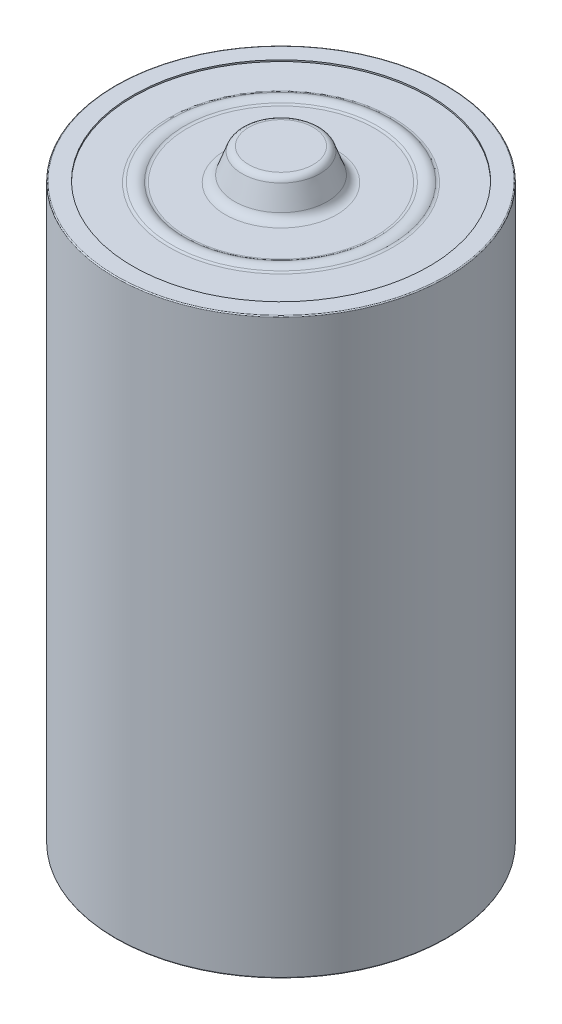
from build123d import *


with BuildPart() as part:
    # Sketch1 → Revolve1 (revolve)
    with BuildSketch(Plane(origin=(0, 0, 0), x_dir=(0, 0, -1), z_dir=(1, 0, 0)), mode=Mode.PRIVATE) as revolve1_sk:
        with BuildLine():
            Line((-16.5, 57.2), (-16.5, 0.3))
            ThreePointArc((-16.5, 0.3), (-16.470710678, 0.229289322), (-16.4, 0.2))
            Line((-16.4, 0.2), (-13.5, 0.2))
            Line((-13.5, 0.2), (-13.5, 0.25))
            Line((-13.5, 0.25), (-12.5, 0.25))
            Line((-12.5, 0.25), (-12.5, 0.35))
            Line((-12.5, 0.35), (-9.694776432, 0.35))
            ThreePointArc((-9.694776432, 0.35), (-9.527885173, 0.321325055), (-9.380136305, 0.238589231))
            ThreePointArc((-9.380136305, 0.238589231), (-8.625, -0.028796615), (-7.869863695, 0.238589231))
            ThreePointArc((-7.869863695, 0.238589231), (-7.722114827, 0.321325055), (-7.555223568, 0.35))
            Line((-7.555223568, 0.35), (-5.033263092, 0.35))
            ThreePointArc((-5.033263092, 0.35), (-5.000315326, 0.348913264), (-4.967510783, 0.345657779))
            ThreePointArc((-4.967510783, 0.345657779), (-3.867097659, 0.236454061), (-2.761880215, 0.2))
            Line((-2.761880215, 0.2), (-2.25055535, 0.2))
            ThreePointArc((-2.25055535, 0.2), (-2.00055535, 0.266987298), (-1.817542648, 0.45))
            Line((-1.817542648, 0.45), (-1.58660254, 0.85))
            ThreePointArc((-1.58660254, 0.85), (-1.476794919, 0.959807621), (-1.326794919, 1))
            Line((-1.326794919, 1), (0, 1))
            Line((0, 1), (0, 60.3))
            Line((0, 60.3), (-3.209854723, 60.3))
            ThreePointArc((-3.209854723, 60.3), (-3.611358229, 60.173406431), (-3.867639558, 59.8394141))
            Line((-3.867639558, 59.8394141), (-4.607021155, 57.807979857))
            ThreePointArc((-4.607021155, 57.807979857), (-4.97313734, 57.330847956), (-5.546713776, 57.15))
            Line((-5.546713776, 57.15), (-9.341291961, 57.15))
            ThreePointArc((-9.341291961, 57.15), (-9.480420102, 57.169746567), (-9.608559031, 57.227426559))
            ThreePointArc((-9.608559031, 57.227426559), (-10.25, 57.4132503), (-10.891440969, 57.227426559))
            ThreePointArc((-10.891440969, 57.227426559), (-11.019579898, 57.169746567), (-11.158708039, 57.15))
            Line((-11.158708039, 57.15), (-14.75, 57.15))
            Line((-14.75, 57.15), (-14.75, 57.3))
            Line((-14.75, 57.3), (-16.4, 57.3))
            ThreePointArc((-16.4, 57.3), (-16.470710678, 57.270710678), (-16.5, 57.2))
        make_face()
    revolve(revolve1_sk.sketch.rotate(Axis((0, 0, 0), (0, 1, 0)), 180), axis=Axis((0, 0, 0), (0, 1, 0)))


solid = part.part
